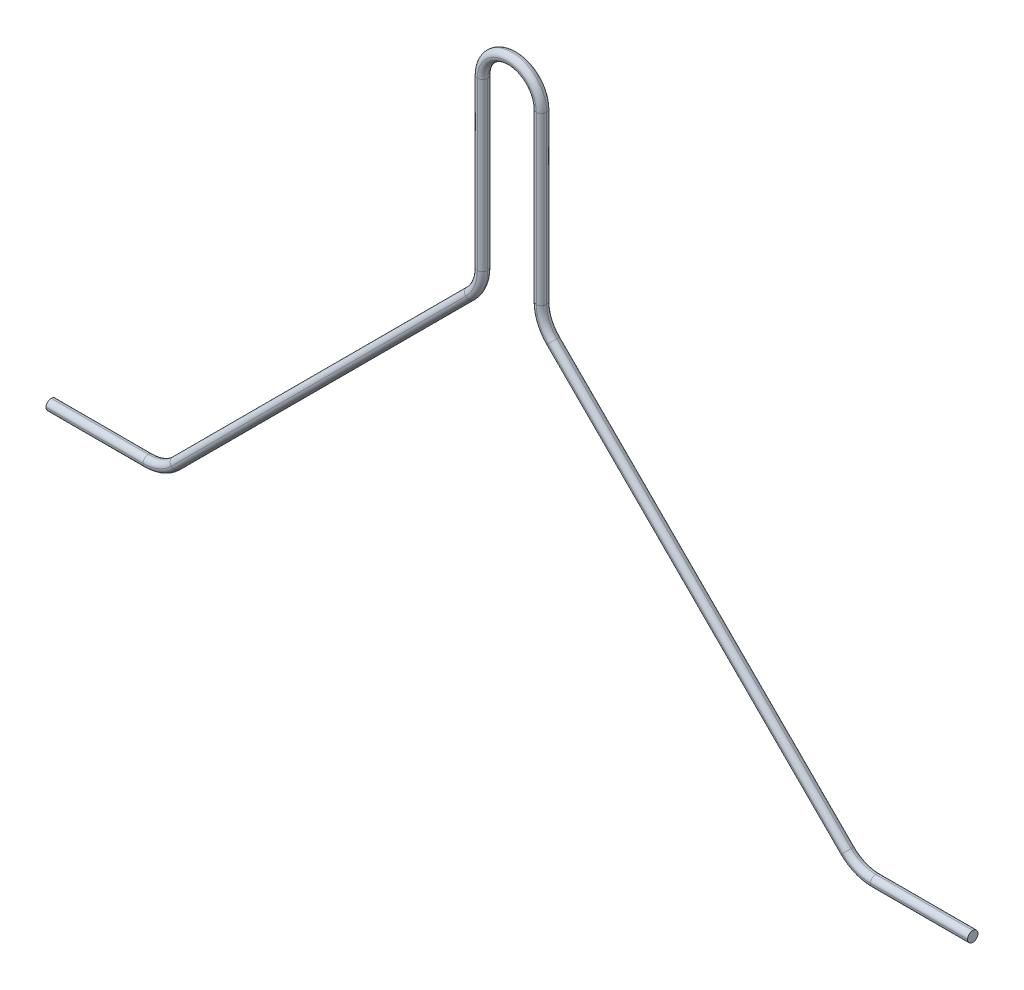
ISO-10303-21;
HEADER;
FILE_DESCRIPTION(('STEP AP214'),'2;1');
FILE_NAME('part.step','',(''),(''),'','','');
FILE_SCHEMA(('AUTOMOTIVE_DESIGN { 1 0 10303 214 1 1 1 1 }'));
ENDSEC;
DATA;
#1=APPLICATION_CONTEXT('core data for automotive mechanical design processes');
#2=APPLICATION_PROTOCOL_DEFINITION('international standard','automotive_design',2000,#1);
#3=PRODUCT_CONTEXT('',#1,'mechanical');
#4=PRODUCT('Part','Part','',(#3));
#5=PRODUCT_RELATED_PRODUCT_CATEGORY('part','',(#4));
#6=PRODUCT_DEFINITION_FORMATION('','',#4);
#7=PRODUCT_DEFINITION_CONTEXT('part definition',#1,'design');
#8=PRODUCT_DEFINITION('design','',#6,#7);
#9=PRODUCT_DEFINITION_SHAPE('','',#8);
#10=(LENGTH_UNIT() NAMED_UNIT(*) SI_UNIT(.MILLI.,.METRE.));
#11=(NAMED_UNIT(*) PLANE_ANGLE_UNIT() SI_UNIT($,.RADIAN.));
#12=(NAMED_UNIT(*) SI_UNIT($,.STERADIAN.) SOLID_ANGLE_UNIT());
#13=UNCERTAINTY_MEASURE_WITH_UNIT(LENGTH_MEASURE(1.E-05),#10,'distance_accuracy_value','');
#14=(GEOMETRIC_REPRESENTATION_CONTEXT(3) GLOBAL_UNCERTAINTY_ASSIGNED_CONTEXT((#13)) GLOBAL_UNIT_ASSIGNED_CONTEXT((#10,
#11,#12)) REPRESENTATION_CONTEXT('',''));
#15=CARTESIAN_POINT('',(0.,0.,0.));
#16=DIRECTION('',(0.,0.,1.));
#17=DIRECTION('',(1.,0.,0.));
#18=AXIS2_PLACEMENT_3D('',#15,#16,#17);
#19=CARTESIAN_POINT('',(-66.4264068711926,-71.4264068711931,1.5));
#20=DIRECTION('',(1.,0.,0.));
#21=DIRECTION('',(0.,0.,-1.));
#22=AXIS2_PLACEMENT_3D('',#19,#20,#21);
#23=PLANE('',#22);
#24=CARTESIAN_POINT('',(-66.4264068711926,-72.1764068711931,0.75));
#25=DIRECTION('',(1.,0.,0.));
#26=DIRECTION('',(0.,0.,-1.));
#27=AXIS2_PLACEMENT_3D('',#24,#25,#26);
#28=CIRCLE('',#27,0.75);
#29=CARTESIAN_POINT('',(-66.4264068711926,-71.4264068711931,0.75));
#30=VERTEX_POINT('',#29);
#31=CARTESIAN_POINT('',(-66.4264068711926,-72.1764068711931,0.));
#32=VERTEX_POINT('',#31);
#33=EDGE_CURVE('E43',#30,#32,#28,.F.);
#34=ORIENTED_EDGE('',*,*,#33,.T.);
#35=CARTESIAN_POINT('',(-66.4264068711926,-72.1764068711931,0.75));
#36=DIRECTION('',(1.,0.,0.));
#37=DIRECTION('',(0.,0.,-1.));
#38=AXIS2_PLACEMENT_3D('',#35,#36,#37);
#39=CIRCLE('',#38,0.75);
#40=CARTESIAN_POINT('',(-66.4264068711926,-72.9264068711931,0.75));
#41=VERTEX_POINT('',#40);
#42=EDGE_CURVE('E11',#32,#41,#39,.F.);
#43=ORIENTED_EDGE('',*,*,#42,.T.);
#44=CARTESIAN_POINT('',(-66.4264068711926,-72.1764068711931,0.75));
#45=DIRECTION('',(1.,0.,0.));
#46=DIRECTION('',(0.,0.,-1.));
#47=AXIS2_PLACEMENT_3D('',#44,#45,#46);
#48=CIRCLE('',#47,0.75);
#49=CARTESIAN_POINT('',(-66.4264068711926,-72.1764068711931,1.5));
#50=VERTEX_POINT('',#49);
#51=EDGE_CURVE('E218',#41,#50,#48,.F.);
#52=ORIENTED_EDGE('',*,*,#51,.T.);
#53=CARTESIAN_POINT('',(-66.4264068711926,-72.1764068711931,0.75));
#54=DIRECTION('',(1.,0.,0.));
#55=DIRECTION('',(0.,0.,-1.));
#56=AXIS2_PLACEMENT_3D('',#53,#54,#55);
#57=CIRCLE('',#56,0.75);
#58=EDGE_CURVE('E52',#50,#30,#57,.F.);
#59=ORIENTED_EDGE('',*,*,#58,.T.);
#60=EDGE_LOOP('',(#34,#43,#52,#59));
#61=FACE_BOUND('',#60,.T.);
#62=ADVANCED_FACE('F33',(#61),#23,.F.);
#63=CARTESIAN_POINT('',(66.4264068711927,-71.4264068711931,1.5));
#64=DIRECTION('',(-1.,0.,0.));
#65=DIRECTION('',(0.,0.,1.));
#66=AXIS2_PLACEMENT_3D('',#63,#64,#65);
#67=PLANE('',#66);
#68=CARTESIAN_POINT('',(66.4264068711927,-72.1764068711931,0.75));
#69=DIRECTION('',(-1.,0.,0.));
#70=DIRECTION('',(0.,0.,1.));
#71=AXIS2_PLACEMENT_3D('',#68,#69,#70);
#72=CIRCLE('',#71,0.75);
#73=CARTESIAN_POINT('',(66.4264068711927,-72.1764068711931,1.5));
#74=VERTEX_POINT('',#73);
#75=CARTESIAN_POINT('',(66.4264068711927,-72.9264068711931,0.75));
#76=VERTEX_POINT('',#75);
#77=EDGE_CURVE('E235',#74,#76,#72,.F.);
#78=ORIENTED_EDGE('',*,*,#77,.T.);
#79=CARTESIAN_POINT('',(66.4264068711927,-72.1764068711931,0.75));
#80=DIRECTION('',(-1.,0.,0.));
#81=DIRECTION('',(0.,0.,1.));
#82=AXIS2_PLACEMENT_3D('',#79,#80,#81);
#83=CIRCLE('',#82,0.75);
#84=CARTESIAN_POINT('',(66.4264068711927,-72.1764068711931,0.));
#85=VERTEX_POINT('',#84);
#86=EDGE_CURVE('E244',#76,#85,#83,.F.);
#87=ORIENTED_EDGE('',*,*,#86,.T.);
#88=CARTESIAN_POINT('',(66.4264068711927,-72.1764068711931,0.75));
#89=DIRECTION('',(-1.,0.,0.));
#90=DIRECTION('',(0.,0.,1.));
#91=AXIS2_PLACEMENT_3D('',#88,#89,#90);
#92=CIRCLE('',#91,0.75);
#93=CARTESIAN_POINT('',(66.4264068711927,-71.4264068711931,0.75));
#94=VERTEX_POINT('',#93);
#95=EDGE_CURVE('E240',#85,#94,#92,.F.);
#96=ORIENTED_EDGE('',*,*,#95,.T.);
#97=CARTESIAN_POINT('',(66.4264068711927,-72.1764068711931,0.75));
#98=DIRECTION('',(-1.,0.,0.));
#99=DIRECTION('',(0.,0.,1.));
#100=AXIS2_PLACEMENT_3D('',#97,#98,#99);
#101=CIRCLE('',#100,0.75);
#102=EDGE_CURVE('E234',#94,#74,#101,.F.);
#103=ORIENTED_EDGE('',*,*,#102,.T.);
#104=EDGE_LOOP('',(#78,#87,#96,#103));
#105=FACE_BOUND('',#104,.T.);
#106=ADVANCED_FACE('F587',(#105),#67,.F.);
#107=CARTESIAN_POINT('',(0.,-72.1764068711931,0.75));
#108=DIRECTION('',(-1.,0.,0.));
#109=DIRECTION('',(0.,-1.,0.));
#110=AXIS2_PLACEMENT_3D('',#107,#108,#109);
#111=CYLINDRICAL_SURFACE('',#110,0.75);
#112=DIRECTION('',(-1.,0.,0.));
#113=VECTOR('',#112,1.);
#114=CARTESIAN_POINT('',(-66.4264068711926,-71.4264068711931,0.75));
#115=LINE('',#114,#113);
#116=CARTESIAN_POINT('',(-52.4264068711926,-71.4264068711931,0.75));
#117=VERTEX_POINT('',#116);
#118=EDGE_CURVE('E37',#30,#117,#115,.F.);
#119=ORIENTED_EDGE('',*,*,#118,.F.);
#120=ORIENTED_EDGE('',*,*,#58,.F.);
#121=DIRECTION('',(-1.,0.,0.));
#122=VECTOR('',#121,1.);
#123=CARTESIAN_POINT('',(0.,-72.1764068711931,1.5));
#124=LINE('',#123,#122);
#125=CARTESIAN_POINT('',(-52.4264068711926,-72.1764068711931,1.5));
#126=VERTEX_POINT('',#125);
#127=EDGE_CURVE('E176',#126,#50,#124,.T.);
#128=ORIENTED_EDGE('',*,*,#127,.F.);
#129=CARTESIAN_POINT('',(-52.4264068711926,-72.1764068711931,0.75));
#130=DIRECTION('',(1.,0.,0.));
#131=DIRECTION('',(0.,0.,-1.));
#132=AXIS2_PLACEMENT_3D('',#129,#130,#131);
#133=CIRCLE('',#132,0.75);
#134=EDGE_CURVE('E233',#117,#126,#133,.T.);
#135=ORIENTED_EDGE('',*,*,#134,.F.);
#136=EDGE_LOOP('',(#119,#120,#128,#135));
#137=FACE_BOUND('',#136,.T.);
#138=ADVANCED_FACE('F35',(#137),#111,.T.);
#139=CARTESIAN_POINT('',(-66.4264068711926,-72.1764068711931,0.75));
#140=DIRECTION('',(1.,0.,0.));
#141=DIRECTION('',(0.,1.,0.));
#142=AXIS2_PLACEMENT_3D('',#139,#140,#141);
#143=CYLINDRICAL_SURFACE('',#142,0.75);
#144=ORIENTED_EDGE('',*,*,#33,.F.);
#145=ORIENTED_EDGE('',*,*,#118,.T.);
#146=CARTESIAN_POINT('',(-52.4264068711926,-72.1764068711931,0.75));
#147=DIRECTION('',(1.,0.,0.));
#148=DIRECTION('',(0.,0.,-1.));
#149=AXIS2_PLACEMENT_3D('',#146,#147,#148);
#150=CIRCLE('',#149,0.75);
#151=CARTESIAN_POINT('',(-52.4264068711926,-72.1764068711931,0.));
#152=VERTEX_POINT('',#151);
#153=EDGE_CURVE('E225',#152,#117,#150,.T.);
#154=ORIENTED_EDGE('',*,*,#153,.F.);
#155=DIRECTION('',(-1.,0.,0.));
#156=VECTOR('',#155,1.);
#157=CARTESIAN_POINT('',(-52.4264068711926,-72.1764068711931,0.));
#158=LINE('',#157,#156);
#159=EDGE_CURVE('E215',#32,#152,#158,.F.);
#160=ORIENTED_EDGE('',*,*,#159,.F.);
#161=EDGE_LOOP('',(#144,#145,#154,#160));
#162=FACE_BOUND('',#161,.T.);
#163=ADVANCED_FACE('F223',(#162),#143,.T.);
#164=CARTESIAN_POINT('',(0.,-72.1764068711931,0.75));
#165=DIRECTION('',(1.,0.,0.));
#166=DIRECTION('',(0.,0.,-1.));
#167=AXIS2_PLACEMENT_3D('',#164,#165,#166);
#168=CYLINDRICAL_SURFACE('',#167,0.75);
#169=ORIENTED_EDGE('',*,*,#127,.T.);
#170=ORIENTED_EDGE('',*,*,#51,.F.);
#171=DIRECTION('',(1.,0.,0.));
#172=VECTOR('',#171,1.);
#173=CARTESIAN_POINT('',(-66.4264068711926,-72.9264068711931,0.75));
#174=LINE('',#173,#172);
#175=CARTESIAN_POINT('',(-52.4264068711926,-72.9264068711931,0.75));
#176=VERTEX_POINT('',#175);
#177=EDGE_CURVE('E205',#176,#41,#174,.F.);
#178=ORIENTED_EDGE('',*,*,#177,.F.);
#179=CARTESIAN_POINT('',(-52.4264068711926,-72.1764068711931,0.75));
#180=DIRECTION('',(1.,0.,0.));
#181=DIRECTION('',(0.,0.,-1.));
#182=AXIS2_PLACEMENT_3D('',#179,#180,#181);
#183=CIRCLE('',#182,0.75);
#184=EDGE_CURVE('E216',#126,#176,#183,.T.);
#185=ORIENTED_EDGE('',*,*,#184,.F.);
#186=EDGE_LOOP('',(#169,#170,#178,#185));
#187=FACE_BOUND('',#186,.T.);
#188=ADVANCED_FACE('F219',(#187),#168,.T.);
#189=CARTESIAN_POINT('',(-52.4264068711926,-66.4264068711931,0.75));
#190=DIRECTION('',(0.,0.,-1.));
#191=DIRECTION('',(-1.,0.,0.));
#192=AXIS2_PLACEMENT_3D('',#189,#190,#191);
#193=TOROIDAL_SURFACE('',#192,5.74999999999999,0.75);
#194=CARTESIAN_POINT('',(-52.4264068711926,-66.4264068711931,0.75));
#195=DIRECTION('',(0.,0.,-1.));
#196=DIRECTION('',(-1.,0.,0.));
#197=AXIS2_PLACEMENT_3D('',#194,#195,#196);
#198=CIRCLE('',#197,4.99999999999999);
#199=CARTESIAN_POINT('',(-48.8908729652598,-69.9619407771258,0.75));
#200=VERTEX_POINT('',#199);
#201=EDGE_CURVE('E228',#117,#200,#198,.F.);
#202=ORIENTED_EDGE('',*,*,#201,.F.);
#203=ORIENTED_EDGE('',*,*,#134,.T.);
#204=CARTESIAN_POINT('',(-52.4264068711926,-66.4264068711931,1.5));
#205=DIRECTION('',(0.,0.,-1.));
#206=DIRECTION('',(-1.,0.,0.));
#207=AXIS2_PLACEMENT_3D('',#204,#205,#206);
#208=CIRCLE('',#207,5.74999999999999);
#209=CARTESIAN_POINT('',(-48.3605428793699,-70.4922708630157,1.5));
#210=VERTEX_POINT('',#209);
#211=EDGE_CURVE('E459',#210,#126,#208,.T.);
#212=ORIENTED_EDGE('',*,*,#211,.F.);
#213=CARTESIAN_POINT('',(-48.3605428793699,-70.4922708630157,0.75));
#214=DIRECTION('',(0.707106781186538,0.707106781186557,0.));
#215=DIRECTION('',(-0.707106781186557,0.707106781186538,0.));
#216=AXIS2_PLACEMENT_3D('',#213,#214,#215);
#217=CIRCLE('',#216,0.75);
#218=EDGE_CURVE('E456',#200,#210,#217,.T.);
#219=ORIENTED_EDGE('',*,*,#218,.F.);
#220=EDGE_LOOP('',(#202,#203,#212,#219));
#221=FACE_BOUND('',#220,.T.);
#222=ADVANCED_FACE('F467',(#221),#193,.T.);
#223=CARTESIAN_POINT('',(-52.4264068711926,-66.4264068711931,0.75));
#224=DIRECTION('',(0.,0.,-1.));
#225=DIRECTION('',(-1.,0.,0.));
#226=AXIS2_PLACEMENT_3D('',#223,#224,#225);
#227=TOROIDAL_SURFACE('',#226,5.74999999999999,0.75);
#228=ORIENTED_EDGE('',*,*,#153,.T.);
#229=ORIENTED_EDGE('',*,*,#201,.T.);
#230=CARTESIAN_POINT('',(-48.3605428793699,-70.4922708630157,0.75));
#231=DIRECTION('',(0.707106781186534,0.707106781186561,0.));
#232=DIRECTION('',(-0.707106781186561,0.707106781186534,0.));
#233=AXIS2_PLACEMENT_3D('',#230,#231,#232);
#234=CIRCLE('',#233,0.75);
#235=CARTESIAN_POINT('',(-48.3605428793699,-70.4922708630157,0.));
#236=VERTEX_POINT('',#235);
#237=EDGE_CURVE('E451',#236,#200,#234,.T.);
#238=ORIENTED_EDGE('',*,*,#237,.F.);
#239=CARTESIAN_POINT('',(-52.4264068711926,-66.4264068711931,0.));
#240=DIRECTION('',(0.,0.,-1.));
#241=DIRECTION('',(-1.,0.,0.));
#242=AXIS2_PLACEMENT_3D('',#239,#240,#241);
#243=CIRCLE('',#242,5.74999999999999);
#244=EDGE_CURVE('E448',#152,#236,#243,.F.);
#245=ORIENTED_EDGE('',*,*,#244,.F.);
#246=EDGE_LOOP('',(#228,#229,#238,#245));
#247=FACE_BOUND('',#246,.T.);
#248=ADVANCED_FACE('F477',(#247),#227,.T.);
#249=CARTESIAN_POINT('',(-66.4264068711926,-72.1764068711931,0.75));
#250=DIRECTION('',(-1.,0.,0.));
#251=DIRECTION('',(0.,0.,1.));
#252=AXIS2_PLACEMENT_3D('',#249,#250,#251);
#253=CYLINDRICAL_SURFACE('',#252,0.75);
#254=ORIENTED_EDGE('',*,*,#42,.F.);
#255=ORIENTED_EDGE('',*,*,#159,.T.);
#256=CARTESIAN_POINT('',(-52.4264068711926,-72.1764068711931,0.75));
#257=DIRECTION('',(1.,0.,0.));
#258=DIRECTION('',(0.,0.,-1.));
#259=AXIS2_PLACEMENT_3D('',#256,#257,#258);
#260=CIRCLE('',#259,0.75);
#261=EDGE_CURVE('E210',#176,#152,#260,.T.);
#262=ORIENTED_EDGE('',*,*,#261,.F.);
#263=ORIENTED_EDGE('',*,*,#177,.T.);
#264=EDGE_LOOP('',(#254,#255,#262,#263));
#265=FACE_BOUND('',#264,.T.);
#266=ADVANCED_FACE('F207',(#265),#253,.T.);
#267=CARTESIAN_POINT('',(-52.4264068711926,-66.4264068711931,0.75));
#268=DIRECTION('',(0.,0.,-1.));
#269=DIRECTION('',(-1.,0.,0.));
#270=AXIS2_PLACEMENT_3D('',#267,#268,#269);
#271=TOROIDAL_SURFACE('',#270,5.74999999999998,0.75);
#272=ORIENTED_EDGE('',*,*,#211,.T.);
#273=ORIENTED_EDGE('',*,*,#184,.T.);
#274=CARTESIAN_POINT('',(-52.4264068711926,-66.4264068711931,0.75));
#275=DIRECTION('',(0.,0.,-1.));
#276=DIRECTION('',(-1.,0.,0.));
#277=AXIS2_PLACEMENT_3D('',#274,#275,#276);
#278=CIRCLE('',#277,6.49999999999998);
#279=CARTESIAN_POINT('',(-47.83021279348,-71.0226009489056,0.75));
#280=VERTEX_POINT('',#279);
#281=EDGE_CURVE('E445',#280,#176,#278,.T.);
#282=ORIENTED_EDGE('',*,*,#281,.F.);
#283=CARTESIAN_POINT('',(-48.3605428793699,-70.4922708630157,0.75));
#284=DIRECTION('',(0.707106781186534,0.707106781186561,0.));
#285=DIRECTION('',(-0.707106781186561,0.707106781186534,0.));
#286=AXIS2_PLACEMENT_3D('',#283,#284,#285);
#287=CIRCLE('',#286,0.75);
#288=EDGE_CURVE('E442',#210,#280,#287,.T.);
#289=ORIENTED_EDGE('',*,*,#288,.F.);
#290=EDGE_LOOP('',(#272,#273,#282,#289));
#291=FACE_BOUND('',#290,.T.);
#292=ADVANCED_FACE('F462',(#291),#271,.T.);
#293=CARTESIAN_POINT('',(11.0658639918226,-11.0658639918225,0.75));
#294=DIRECTION('',(-0.707106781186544,-0.707106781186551,0.));
#295=DIRECTION('',(0.707106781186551,-0.707106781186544,0.));
#296=AXIS2_PLACEMENT_3D('',#293,#294,#295);
#297=CYLINDRICAL_SURFACE('',#296,0.75);
#298=DIRECTION('',(-0.707106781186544,-0.707106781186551,0.));
#299=VECTOR('',#298,1.);
#300=CARTESIAN_POINT('',(-6.46446609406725,-27.5355339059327,0.75));
#301=LINE('',#300,#299);
#302=CARTESIAN_POINT('',(-6.46446609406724,-27.5355339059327,0.75));
#303=VERTEX_POINT('',#302);
#304=EDGE_CURVE('E454',#200,#303,#301,.F.);
#305=ORIENTED_EDGE('',*,*,#304,.F.);
#306=ORIENTED_EDGE('',*,*,#218,.T.);
#307=DIRECTION('',(-0.707106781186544,-0.707106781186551,0.));
#308=VECTOR('',#307,1.);
#309=CARTESIAN_POINT('',(11.0658639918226,-11.0658639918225,1.5));
#310=LINE('',#309,#308);
#311=CARTESIAN_POINT('',(-5.93413600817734,-28.0658639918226,1.5));
#312=VERTEX_POINT('',#311);
#313=EDGE_CURVE('E439',#312,#210,#310,.T.);
#314=ORIENTED_EDGE('',*,*,#313,.F.);
#315=CARTESIAN_POINT('',(-5.93413600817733,-28.0658639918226,0.75));
#316=DIRECTION('',(0.707106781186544,0.707106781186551,0.));
#317=DIRECTION('',(-0.707106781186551,0.707106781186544,0.));
#318=AXIS2_PLACEMENT_3D('',#315,#316,#317);
#319=CIRCLE('',#318,0.75);
#320=EDGE_CURVE('E436',#303,#312,#319,.T.);
#321=ORIENTED_EDGE('',*,*,#320,.F.);
#322=EDGE_LOOP('',(#305,#306,#314,#321));
#323=FACE_BOUND('',#322,.T.);
#324=ADVANCED_FACE('F470',(#323),#297,.T.);
#325=CARTESIAN_POINT('',(-5.93413600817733,-28.0658639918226,0.75));
#326=DIRECTION('',(0.707106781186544,0.707106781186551,0.));
#327=DIRECTION('',(-0.707106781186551,0.707106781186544,0.));
#328=AXIS2_PLACEMENT_3D('',#325,#326,#327);
#329=CYLINDRICAL_SURFACE('',#328,0.75);
#330=ORIENTED_EDGE('',*,*,#237,.T.);
#331=ORIENTED_EDGE('',*,*,#304,.T.);
#332=CARTESIAN_POINT('',(-5.93413600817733,-28.0658639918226,0.75));
#333=DIRECTION('',(0.707106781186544,0.707106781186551,0.));
#334=DIRECTION('',(-0.707106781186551,0.707106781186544,0.));
#335=AXIS2_PLACEMENT_3D('',#332,#333,#334);
#336=CIRCLE('',#335,0.75);
#337=CARTESIAN_POINT('',(-5.93413600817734,-28.0658639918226,0.));
#338=VERTEX_POINT('',#337);
#339=EDGE_CURVE('E431',#338,#303,#336,.T.);
#340=ORIENTED_EDGE('',*,*,#339,.F.);
#341=DIRECTION('',(-0.707106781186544,-0.707106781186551,0.));
#342=VECTOR('',#341,1.);
#343=CARTESIAN_POINT('',(-5.93413600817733,-28.0658639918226,0.));
#344=LINE('',#343,#342);
#345=EDGE_CURVE('E428',#236,#338,#344,.F.);
#346=ORIENTED_EDGE('',*,*,#345,.F.);
#347=EDGE_LOOP('',(#330,#331,#340,#346));
#348=FACE_BOUND('',#347,.T.);
#349=ADVANCED_FACE('F475',(#348),#329,.T.);
#350=CARTESIAN_POINT('',(-52.4264068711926,-66.4264068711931,0.75));
#351=DIRECTION('',(0.,0.,-1.));
#352=DIRECTION('',(-1.,0.,0.));
#353=AXIS2_PLACEMENT_3D('',#350,#351,#352);
#354=TOROIDAL_SURFACE('',#353,5.74999999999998,0.75);
#355=ORIENTED_EDGE('',*,*,#261,.T.);
#356=ORIENTED_EDGE('',*,*,#244,.T.);
#357=CARTESIAN_POINT('',(-48.3605428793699,-70.4922708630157,0.75));
#358=DIRECTION('',(0.707106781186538,0.707106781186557,0.));
#359=DIRECTION('',(-0.707106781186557,0.707106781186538,0.));
#360=AXIS2_PLACEMENT_3D('',#357,#358,#359);
#361=CIRCLE('',#360,0.75);
#362=EDGE_CURVE('E425',#280,#236,#361,.T.);
#363=ORIENTED_EDGE('',*,*,#362,.F.);
#364=ORIENTED_EDGE('',*,*,#281,.T.);
#365=EDGE_LOOP('',(#355,#356,#363,#364));
#366=FACE_BOUND('',#365,.T.);
#367=ADVANCED_FACE('F480',(#366),#354,.T.);
#368=CARTESIAN_POINT('',(11.0658639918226,-11.0658639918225,0.75));
#369=DIRECTION('',(0.707106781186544,0.707106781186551,0.));
#370=DIRECTION('',(-0.707106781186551,0.707106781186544,0.));
#371=AXIS2_PLACEMENT_3D('',#368,#369,#370);
#372=CYLINDRICAL_SURFACE('',#371,0.75);
#373=ORIENTED_EDGE('',*,*,#313,.T.);
#374=ORIENTED_EDGE('',*,*,#288,.T.);
#375=DIRECTION('',(0.707106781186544,0.707106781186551,0.));
#376=VECTOR('',#375,1.);
#377=CARTESIAN_POINT('',(-5.40380592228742,-28.5961940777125,0.75));
#378=LINE('',#377,#376);
#379=CARTESIAN_POINT('',(-5.40380592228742,-28.5961940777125,0.75));
#380=VERTEX_POINT('',#379);
#381=EDGE_CURVE('E422',#380,#280,#378,.F.);
#382=ORIENTED_EDGE('',*,*,#381,.F.);
#383=CARTESIAN_POINT('',(-5.93413600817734,-28.0658639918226,0.75));
#384=DIRECTION('',(0.707106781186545,0.70710678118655,0.));
#385=DIRECTION('',(-0.70710678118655,0.707106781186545,0.));
#386=AXIS2_PLACEMENT_3D('',#383,#384,#385);
#387=CIRCLE('',#386,0.75);
#388=EDGE_CURVE('E419',#312,#380,#387,.T.);
#389=ORIENTED_EDGE('',*,*,#388,.F.);
#390=EDGE_LOOP('',(#373,#374,#382,#389));
#391=FACE_BOUND('',#390,.T.);
#392=ADVANCED_FACE('F486',(#391),#372,.T.);
#393=CARTESIAN_POINT('',(-9.99999999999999,-24.,0.75));
#394=DIRECTION('',(0.,0.,-1.));
#395=DIRECTION('',(-1.,0.,0.));
#396=AXIS2_PLACEMENT_3D('',#393,#394,#395);
#397=TOROIDAL_SURFACE('',#396,5.74999999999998,0.75);
#398=CARTESIAN_POINT('',(-9.99999999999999,-24.,0.75));
#399=DIRECTION('',(0.,0.,-1.));
#400=DIRECTION('',(-1.,0.,0.));
#401=AXIS2_PLACEMENT_3D('',#398,#399,#400);
#402=CIRCLE('',#401,4.99999999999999);
#403=CARTESIAN_POINT('',(-5.00000000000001,-24.,0.75));
#404=VERTEX_POINT('',#403);
#405=EDGE_CURVE('E434',#303,#404,#402,.F.);
#406=ORIENTED_EDGE('',*,*,#405,.F.);
#407=ORIENTED_EDGE('',*,*,#320,.T.);
#408=CARTESIAN_POINT('',(-9.99999999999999,-24.,1.5));
#409=DIRECTION('',(0.,0.,-1.));
#410=DIRECTION('',(-1.,0.,0.));
#411=AXIS2_PLACEMENT_3D('',#408,#409,#410);
#412=CIRCLE('',#411,5.74999999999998);
#413=CARTESIAN_POINT('',(-4.25000000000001,-24.,1.5));
#414=VERTEX_POINT('',#413);
#415=EDGE_CURVE('E416',#414,#312,#412,.T.);
#416=ORIENTED_EDGE('',*,*,#415,.F.);
#417=CARTESIAN_POINT('',(-4.25000000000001,-24.,0.75));
#418=DIRECTION('',(0.,1.,0.));
#419=DIRECTION('',(0.,0.,1.));
#420=AXIS2_PLACEMENT_3D('',#417,#418,#419);
#421=CIRCLE('',#420,0.75);
#422=EDGE_CURVE('E413',#404,#414,#421,.T.);
#423=ORIENTED_EDGE('',*,*,#422,.F.);
#424=EDGE_LOOP('',(#406,#407,#416,#423));
#425=FACE_BOUND('',#424,.T.);
#426=ADVANCED_FACE('F492',(#425),#397,.T.);
#427=CARTESIAN_POINT('',(-9.99999999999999,-24.,0.75));
#428=DIRECTION('',(0.,0.,-1.));
#429=DIRECTION('',(-1.,0.,0.));
#430=AXIS2_PLACEMENT_3D('',#427,#428,#429);
#431=TOROIDAL_SURFACE('',#430,5.74999999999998,0.75);
#432=ORIENTED_EDGE('',*,*,#339,.T.);
#433=ORIENTED_EDGE('',*,*,#405,.T.);
#434=CARTESIAN_POINT('',(-4.25000000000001,-24.,0.75));
#435=DIRECTION('',(0.,1.,0.));
#436=DIRECTION('',(0.,0.,1.));
#437=AXIS2_PLACEMENT_3D('',#434,#435,#436);
#438=CIRCLE('',#437,0.75);
#439=CARTESIAN_POINT('',(-4.25000000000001,-24.,0.));
#440=VERTEX_POINT('',#439);
#441=EDGE_CURVE('E408',#440,#404,#438,.T.);
#442=ORIENTED_EDGE('',*,*,#441,.F.);
#443=CARTESIAN_POINT('',(-9.99999999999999,-24.,0.));
#444=DIRECTION('',(0.,0.,-1.));
#445=DIRECTION('',(-1.,0.,0.));
#446=AXIS2_PLACEMENT_3D('',#443,#444,#445);
#447=CIRCLE('',#446,5.74999999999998);
#448=EDGE_CURVE('E405',#338,#440,#447,.F.);
#449=ORIENTED_EDGE('',*,*,#448,.F.);
#450=EDGE_LOOP('',(#432,#433,#442,#449));
#451=FACE_BOUND('',#450,.T.);
#452=ADVANCED_FACE('F503',(#451),#431,.T.);
#453=CARTESIAN_POINT('',(-5.93413600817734,-28.0658639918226,0.75));
#454=DIRECTION('',(-0.707106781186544,-0.707106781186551,0.));
#455=DIRECTION('',(0.707106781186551,-0.707106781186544,0.));
#456=AXIS2_PLACEMENT_3D('',#453,#454,#455);
#457=CYLINDRICAL_SURFACE('',#456,0.75);
#458=ORIENTED_EDGE('',*,*,#362,.T.);
#459=ORIENTED_EDGE('',*,*,#345,.T.);
#460=CARTESIAN_POINT('',(-5.93413600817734,-28.0658639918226,0.75));
#461=DIRECTION('',(0.707106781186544,0.707106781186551,0.));
#462=DIRECTION('',(-0.707106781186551,0.707106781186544,0.));
#463=AXIS2_PLACEMENT_3D('',#460,#461,#462);
#464=CIRCLE('',#463,0.75);
#465=EDGE_CURVE('E402',#380,#338,#464,.T.);
#466=ORIENTED_EDGE('',*,*,#465,.F.);
#467=ORIENTED_EDGE('',*,*,#381,.T.);
#468=EDGE_LOOP('',(#458,#459,#466,#467));
#469=FACE_BOUND('',#468,.T.);
#470=ADVANCED_FACE('F483',(#469),#457,.T.);
#471=CARTESIAN_POINT('',(-9.99999999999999,-24.,0.75));
#472=DIRECTION('',(0.,0.,-1.));
#473=DIRECTION('',(-1.,0.,0.));
#474=AXIS2_PLACEMENT_3D('',#471,#472,#473);
#475=TOROIDAL_SURFACE('',#474,5.74999999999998,0.75);
#476=ORIENTED_EDGE('',*,*,#415,.T.);
#477=ORIENTED_EDGE('',*,*,#388,.T.);
#478=CARTESIAN_POINT('',(-9.99999999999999,-24.,0.75));
#479=DIRECTION('',(0.,0.,-1.));
#480=DIRECTION('',(-1.,0.,0.));
#481=AXIS2_PLACEMENT_3D('',#478,#479,#480);
#482=CIRCLE('',#481,6.49999999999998);
#483=CARTESIAN_POINT('',(-3.50000000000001,-24.,0.75));
#484=VERTEX_POINT('',#483);
#485=EDGE_CURVE('E399',#484,#380,#482,.T.);
#486=ORIENTED_EDGE('',*,*,#485,.F.);
#487=CARTESIAN_POINT('',(-4.25000000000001,-24.,0.75));
#488=DIRECTION('',(0.,1.,0.));
#489=DIRECTION('',(0.,0.,1.));
#490=AXIS2_PLACEMENT_3D('',#487,#488,#489);
#491=CIRCLE('',#490,0.75);
#492=EDGE_CURVE('E396',#414,#484,#491,.T.);
#493=ORIENTED_EDGE('',*,*,#492,.F.);
#494=EDGE_LOOP('',(#476,#477,#486,#493));
#495=FACE_BOUND('',#494,.T.);
#496=ADVANCED_FACE('F488',(#495),#475,.T.);
#497=CARTESIAN_POINT('',(-4.25,0.,0.75));
#498=DIRECTION('',(0.,-1.,0.));
#499=DIRECTION('',(1.,0.,0.));
#500=AXIS2_PLACEMENT_3D('',#497,#498,#499);
#501=CYLINDRICAL_SURFACE('',#500,0.75);
#502=DIRECTION('',(0.,-1.,0.));
#503=VECTOR('',#502,1.);
#504=CARTESIAN_POINT('',(-5.,0.,0.75));
#505=LINE('',#504,#503);
#506=CARTESIAN_POINT('',(-5.,0.,0.75));
#507=VERTEX_POINT('',#506);
#508=EDGE_CURVE('E411',#404,#507,#505,.F.);
#509=ORIENTED_EDGE('',*,*,#508,.F.);
#510=ORIENTED_EDGE('',*,*,#422,.T.);
#511=DIRECTION('',(0.,-1.,0.));
#512=VECTOR('',#511,1.);
#513=CARTESIAN_POINT('',(-4.25,0.,1.5));
#514=LINE('',#513,#512);
#515=CARTESIAN_POINT('',(-4.25,0.,1.5));
#516=VERTEX_POINT('',#515);
#517=EDGE_CURVE('E393',#516,#414,#514,.T.);
#518=ORIENTED_EDGE('',*,*,#517,.F.);
#519=CARTESIAN_POINT('',(-4.25,0.,0.75));
#520=DIRECTION('',(0.,1.,0.));
#521=DIRECTION('',(-1.,0.,0.));
#522=AXIS2_PLACEMENT_3D('',#519,#520,#521);
#523=CIRCLE('',#522,0.75);
#524=EDGE_CURVE('E390',#507,#516,#523,.T.);
#525=ORIENTED_EDGE('',*,*,#524,.F.);
#526=EDGE_LOOP('',(#509,#510,#518,#525));
#527=FACE_BOUND('',#526,.T.);
#528=ADVANCED_FACE('F495',(#527),#501,.T.);
#529=CARTESIAN_POINT('',(-4.25,0.,0.75));
#530=DIRECTION('',(0.,1.,0.));
#531=DIRECTION('',(-1.,0.,0.));
#532=AXIS2_PLACEMENT_3D('',#529,#530,#531);
#533=CYLINDRICAL_SURFACE('',#532,0.75);
#534=ORIENTED_EDGE('',*,*,#441,.T.);
#535=ORIENTED_EDGE('',*,*,#508,.T.);
#536=CARTESIAN_POINT('',(-4.25,0.,0.75));
#537=DIRECTION('',(0.,1.,0.));
#538=DIRECTION('',(-1.,0.,0.));
#539=AXIS2_PLACEMENT_3D('',#536,#537,#538);
#540=CIRCLE('',#539,0.75);
#541=CARTESIAN_POINT('',(-4.25,0.,0.));
#542=VERTEX_POINT('',#541);
#543=EDGE_CURVE('E385',#542,#507,#540,.T.);
#544=ORIENTED_EDGE('',*,*,#543,.F.);
#545=DIRECTION('',(0.,-1.,0.));
#546=VECTOR('',#545,1.);
#547=CARTESIAN_POINT('',(-4.25,0.,0.));
#548=LINE('',#547,#546);
#549=EDGE_CURVE('E382',#440,#542,#548,.F.);
#550=ORIENTED_EDGE('',*,*,#549,.F.);
#551=EDGE_LOOP('',(#534,#535,#544,#550));
#552=FACE_BOUND('',#551,.T.);
#553=ADVANCED_FACE('F500',(#552),#533,.T.);
#554=CARTESIAN_POINT('',(-9.99999999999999,-24.,0.75));
#555=DIRECTION('',(0.,0.,-1.));
#556=DIRECTION('',(-1.,0.,0.));
#557=AXIS2_PLACEMENT_3D('',#554,#555,#556);
#558=TOROIDAL_SURFACE('',#557,5.74999999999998,0.75);
#559=ORIENTED_EDGE('',*,*,#465,.T.);
#560=ORIENTED_EDGE('',*,*,#448,.T.);
#561=CARTESIAN_POINT('',(-4.25000000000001,-24.,0.75));
#562=DIRECTION('',(0.,1.,0.));
#563=DIRECTION('',(0.,0.,1.));
#564=AXIS2_PLACEMENT_3D('',#561,#562,#563);
#565=CIRCLE('',#564,0.75);
#566=EDGE_CURVE('E379',#484,#440,#565,.T.);
#567=ORIENTED_EDGE('',*,*,#566,.F.);
#568=ORIENTED_EDGE('',*,*,#485,.T.);
#569=EDGE_LOOP('',(#559,#560,#567,#568));
#570=FACE_BOUND('',#569,.T.);
#571=ADVANCED_FACE('F506',(#570),#558,.T.);
#572=CARTESIAN_POINT('',(-4.25,0.,0.75));
#573=DIRECTION('',(0.,1.,0.));
#574=DIRECTION('',(-1.,0.,0.));
#575=AXIS2_PLACEMENT_3D('',#572,#573,#574);
#576=CYLINDRICAL_SURFACE('',#575,0.75);
#577=ORIENTED_EDGE('',*,*,#517,.T.);
#578=ORIENTED_EDGE('',*,*,#492,.T.);
#579=DIRECTION('',(0.,1.,0.));
#580=VECTOR('',#579,1.);
#581=CARTESIAN_POINT('',(-3.5,0.,0.75));
#582=LINE('',#581,#580);
#583=CARTESIAN_POINT('',(-3.5,0.,0.75));
#584=VERTEX_POINT('',#583);
#585=EDGE_CURVE('E376',#584,#484,#582,.F.);
#586=ORIENTED_EDGE('',*,*,#585,.F.);
#587=CARTESIAN_POINT('',(-4.25,0.,0.75));
#588=DIRECTION('',(0.,1.,0.));
#589=DIRECTION('',(-1.,0.,0.));
#590=AXIS2_PLACEMENT_3D('',#587,#588,#589);
#591=CIRCLE('',#590,0.75);
#592=EDGE_CURVE('E373',#516,#584,#591,.T.);
#593=ORIENTED_EDGE('',*,*,#592,.F.);
#594=EDGE_LOOP('',(#577,#578,#586,#593));
#595=FACE_BOUND('',#594,.T.);
#596=ADVANCED_FACE('F512',(#595),#576,.T.);
#597=CARTESIAN_POINT('',(0.,0.,0.75));
#598=DIRECTION('',(0.,0.,-1.));
#599=DIRECTION('',(-1.,0.,0.));
#600=AXIS2_PLACEMENT_3D('',#597,#598,#599);
#601=TOROIDAL_SURFACE('',#600,4.25,0.75);
#602=CARTESIAN_POINT('',(0.,0.,0.75));
#603=DIRECTION('',(0.,0.,-1.));
#604=DIRECTION('',(-1.,0.,0.));
#605=AXIS2_PLACEMENT_3D('',#602,#603,#604);
#606=CIRCLE('',#605,5.);
#607=CARTESIAN_POINT('',(5.,0.,0.75));
#608=VERTEX_POINT('',#607);
#609=EDGE_CURVE('E388',#507,#608,#606,.T.);
#610=ORIENTED_EDGE('',*,*,#609,.F.);
#611=ORIENTED_EDGE('',*,*,#524,.T.);
#612=CARTESIAN_POINT('',(0.,0.,1.5));
#613=DIRECTION('',(0.,0.,-1.));
#614=DIRECTION('',(-1.,0.,0.));
#615=AXIS2_PLACEMENT_3D('',#612,#613,#614);
#616=CIRCLE('',#615,4.25);
#617=CARTESIAN_POINT('',(4.25,0.,1.5));
#618=VERTEX_POINT('',#617);
#619=EDGE_CURVE('E370',#618,#516,#616,.F.);
#620=ORIENTED_EDGE('',*,*,#619,.F.);
#621=CARTESIAN_POINT('',(4.25,0.,0.75));
#622=DIRECTION('',(0.,-1.,0.));
#623=DIRECTION('',(0.,0.,-1.));
#624=AXIS2_PLACEMENT_3D('',#621,#622,#623);
#625=CIRCLE('',#624,0.75);
#626=EDGE_CURVE('E367',#608,#618,#625,.T.);
#627=ORIENTED_EDGE('',*,*,#626,.F.);
#628=EDGE_LOOP('',(#610,#611,#620,#627));
#629=FACE_BOUND('',#628,.T.);
#630=ADVANCED_FACE('F518',(#629),#601,.T.);
#631=CARTESIAN_POINT('',(0.,0.,0.75));
#632=DIRECTION('',(0.,0.,-1.));
#633=DIRECTION('',(-1.,0.,0.));
#634=AXIS2_PLACEMENT_3D('',#631,#632,#633);
#635=TOROIDAL_SURFACE('',#634,4.25,0.75);
#636=ORIENTED_EDGE('',*,*,#543,.T.);
#637=ORIENTED_EDGE('',*,*,#609,.T.);
#638=CARTESIAN_POINT('',(4.25,0.,0.75));
#639=DIRECTION('',(0.,-1.,0.));
#640=DIRECTION('',(1.,0.,0.));
#641=AXIS2_PLACEMENT_3D('',#638,#639,#640);
#642=CIRCLE('',#641,0.75);
#643=CARTESIAN_POINT('',(4.25,0.,0.));
#644=VERTEX_POINT('',#643);
#645=EDGE_CURVE('E362',#644,#608,#642,.T.);
#646=ORIENTED_EDGE('',*,*,#645,.F.);
#647=CARTESIAN_POINT('',(0.,0.,0.));
#648=DIRECTION('',(0.,0.,-1.));
#649=DIRECTION('',(-1.,0.,0.));
#650=AXIS2_PLACEMENT_3D('',#647,#648,#649);
#651=CIRCLE('',#650,4.25);
#652=EDGE_CURVE('E359',#542,#644,#651,.T.);
#653=ORIENTED_EDGE('',*,*,#652,.F.);
#654=EDGE_LOOP('',(#636,#637,#646,#653));
#655=FACE_BOUND('',#654,.T.);
#656=ADVANCED_FACE('F529',(#655),#635,.T.);
#657=CARTESIAN_POINT('',(-4.25,0.,0.75));
#658=DIRECTION('',(0.,-1.,0.));
#659=DIRECTION('',(1.,0.,0.));
#660=AXIS2_PLACEMENT_3D('',#657,#658,#659);
#661=CYLINDRICAL_SURFACE('',#660,0.75);
#662=ORIENTED_EDGE('',*,*,#566,.T.);
#663=ORIENTED_EDGE('',*,*,#549,.T.);
#664=CARTESIAN_POINT('',(-4.25,0.,0.75));
#665=DIRECTION('',(0.,1.,0.));
#666=DIRECTION('',(-1.,0.,0.));
#667=AXIS2_PLACEMENT_3D('',#664,#665,#666);
#668=CIRCLE('',#667,0.75);
#669=EDGE_CURVE('E356',#584,#542,#668,.T.);
#670=ORIENTED_EDGE('',*,*,#669,.F.);
#671=ORIENTED_EDGE('',*,*,#585,.T.);
#672=EDGE_LOOP('',(#662,#663,#670,#671));
#673=FACE_BOUND('',#672,.T.);
#674=ADVANCED_FACE('F509',(#673),#661,.T.);
#675=CARTESIAN_POINT('',(0.,0.,0.75));
#676=DIRECTION('',(0.,0.,-1.));
#677=DIRECTION('',(-1.,0.,0.));
#678=AXIS2_PLACEMENT_3D('',#675,#676,#677);
#679=TOROIDAL_SURFACE('',#678,4.25,0.75);
#680=ORIENTED_EDGE('',*,*,#619,.T.);
#681=ORIENTED_EDGE('',*,*,#592,.T.);
#682=CARTESIAN_POINT('',(0.,0.,0.75));
#683=DIRECTION('',(0.,0.,-1.));
#684=DIRECTION('',(-1.,0.,0.));
#685=AXIS2_PLACEMENT_3D('',#682,#683,#684);
#686=CIRCLE('',#685,3.5);
#687=CARTESIAN_POINT('',(3.5,0.,0.75));
#688=VERTEX_POINT('',#687);
#689=EDGE_CURVE('E353',#688,#584,#686,.F.);
#690=ORIENTED_EDGE('',*,*,#689,.F.);
#691=CARTESIAN_POINT('',(4.25,0.,0.75));
#692=DIRECTION('',(0.,-1.,0.));
#693=DIRECTION('',(0.,0.,-1.));
#694=AXIS2_PLACEMENT_3D('',#691,#692,#693);
#695=CIRCLE('',#694,0.75);
#696=EDGE_CURVE('E350',#618,#688,#695,.T.);
#697=ORIENTED_EDGE('',*,*,#696,.F.);
#698=EDGE_LOOP('',(#680,#681,#690,#697));
#699=FACE_BOUND('',#698,.T.);
#700=ADVANCED_FACE('F514',(#699),#679,.T.);
#701=CARTESIAN_POINT('',(4.25,0.,0.75));
#702=DIRECTION('',(0.,1.,0.));
#703=DIRECTION('',(-1.,0.,0.));
#704=AXIS2_PLACEMENT_3D('',#701,#702,#703);
#705=CYLINDRICAL_SURFACE('',#704,0.75);
#706=DIRECTION('',(0.,1.,0.));
#707=VECTOR('',#706,1.);
#708=CARTESIAN_POINT('',(5.,0.,0.75));
#709=LINE('',#708,#707);
#710=CARTESIAN_POINT('',(5.,-24.,0.75));
#711=VERTEX_POINT('',#710);
#712=EDGE_CURVE('E365',#608,#711,#709,.F.);
#713=ORIENTED_EDGE('',*,*,#712,.F.);
#714=ORIENTED_EDGE('',*,*,#626,.T.);
#715=DIRECTION('',(0.,1.,0.));
#716=VECTOR('',#715,1.);
#717=CARTESIAN_POINT('',(4.25,0.,1.5));
#718=LINE('',#717,#716);
#719=CARTESIAN_POINT('',(4.25,-24.,1.5));
#720=VERTEX_POINT('',#719);
#721=EDGE_CURVE('E347',#720,#618,#718,.T.);
#722=ORIENTED_EDGE('',*,*,#721,.F.);
#723=CARTESIAN_POINT('',(4.25000000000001,-24.,0.75));
#724=DIRECTION('',(0.,-1.,0.));
#725=DIRECTION('',(0.,0.,-1.));
#726=AXIS2_PLACEMENT_3D('',#723,#724,#725);
#727=CIRCLE('',#726,0.75);
#728=EDGE_CURVE('E344',#711,#720,#727,.T.);
#729=ORIENTED_EDGE('',*,*,#728,.F.);
#730=EDGE_LOOP('',(#713,#714,#722,#729));
#731=FACE_BOUND('',#730,.T.);
#732=ADVANCED_FACE('F521',(#731),#705,.T.);
#733=CARTESIAN_POINT('',(4.25,0.,0.75));
#734=DIRECTION('',(0.,-1.,0.));
#735=DIRECTION('',(1.,0.,0.));
#736=AXIS2_PLACEMENT_3D('',#733,#734,#735);
#737=CYLINDRICAL_SURFACE('',#736,0.75);
#738=ORIENTED_EDGE('',*,*,#645,.T.);
#739=ORIENTED_EDGE('',*,*,#712,.T.);
#740=CARTESIAN_POINT('',(4.25000000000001,-24.,0.75));
#741=DIRECTION('',(0.,-1.,0.));
#742=DIRECTION('',(0.,0.,-1.));
#743=AXIS2_PLACEMENT_3D('',#740,#741,#742);
#744=CIRCLE('',#743,0.75);
#745=CARTESIAN_POINT('',(4.25,-24.,0.));
#746=VERTEX_POINT('',#745);
#747=EDGE_CURVE('E339',#746,#711,#744,.T.);
#748=ORIENTED_EDGE('',*,*,#747,.F.);
#749=DIRECTION('',(0.,1.,0.));
#750=VECTOR('',#749,1.);
#751=CARTESIAN_POINT('',(4.25000000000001,-24.,0.));
#752=LINE('',#751,#750);
#753=EDGE_CURVE('E336',#644,#746,#752,.F.);
#754=ORIENTED_EDGE('',*,*,#753,.F.);
#755=EDGE_LOOP('',(#738,#739,#748,#754));
#756=FACE_BOUND('',#755,.T.);
#757=ADVANCED_FACE('F526',(#756),#737,.T.);
#758=CARTESIAN_POINT('',(0.,0.,0.75));
#759=DIRECTION('',(0.,0.,-1.));
#760=DIRECTION('',(-1.,0.,0.));
#761=AXIS2_PLACEMENT_3D('',#758,#759,#760);
#762=TOROIDAL_SURFACE('',#761,4.25,0.75);
#763=ORIENTED_EDGE('',*,*,#669,.T.);
#764=ORIENTED_EDGE('',*,*,#652,.T.);
#765=CARTESIAN_POINT('',(4.25,0.,0.75));
#766=DIRECTION('',(0.,-1.,0.));
#767=DIRECTION('',(0.,0.,-1.));
#768=AXIS2_PLACEMENT_3D('',#765,#766,#767);
#769=CIRCLE('',#768,0.75);
#770=EDGE_CURVE('E333',#688,#644,#769,.T.);
#771=ORIENTED_EDGE('',*,*,#770,.F.);
#772=ORIENTED_EDGE('',*,*,#689,.T.);
#773=EDGE_LOOP('',(#763,#764,#771,#772));
#774=FACE_BOUND('',#773,.T.);
#775=ADVANCED_FACE('F532',(#774),#762,.T.);
#776=CARTESIAN_POINT('',(4.25,0.,0.75));
#777=DIRECTION('',(0.,-1.,0.));
#778=DIRECTION('',(0.,0.,-1.));
#779=AXIS2_PLACEMENT_3D('',#776,#777,#778);
#780=CYLINDRICAL_SURFACE('',#779,0.75);
#781=ORIENTED_EDGE('',*,*,#721,.T.);
#782=ORIENTED_EDGE('',*,*,#696,.T.);
#783=DIRECTION('',(0.,-1.,0.));
#784=VECTOR('',#783,1.);
#785=CARTESIAN_POINT('',(3.5,0.,0.75));
#786=LINE('',#785,#784);
#787=CARTESIAN_POINT('',(3.5,-24.,0.75));
#788=VERTEX_POINT('',#787);
#789=EDGE_CURVE('E330',#788,#688,#786,.F.);
#790=ORIENTED_EDGE('',*,*,#789,.F.);
#791=CARTESIAN_POINT('',(4.25,-24.,0.75));
#792=DIRECTION('',(0.,-1.,0.));
#793=DIRECTION('',(0.,0.,-1.));
#794=AXIS2_PLACEMENT_3D('',#791,#792,#793);
#795=CIRCLE('',#794,0.75);
#796=EDGE_CURVE('E327',#720,#788,#795,.T.);
#797=ORIENTED_EDGE('',*,*,#796,.F.);
#798=EDGE_LOOP('',(#781,#782,#790,#797));
#799=FACE_BOUND('',#798,.T.);
#800=ADVANCED_FACE('F538',(#799),#780,.T.);
#801=CARTESIAN_POINT('',(10.,-24.,0.75));
#802=DIRECTION('',(0.,0.,-1.));
#803=DIRECTION('',(-1.,0.,0.));
#804=AXIS2_PLACEMENT_3D('',#801,#802,#803);
#805=TOROIDAL_SURFACE('',#804,5.75,0.75);
#806=CARTESIAN_POINT('',(10.,-24.,0.75));
#807=DIRECTION('',(0.,0.,-1.));
#808=DIRECTION('',(-1.,0.,0.));
#809=AXIS2_PLACEMENT_3D('',#806,#807,#808);
#810=CIRCLE('',#809,5.);
#811=CARTESIAN_POINT('',(6.46446609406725,-27.5355339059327,0.75));
#812=VERTEX_POINT('',#811);
#813=EDGE_CURVE('E342',#711,#812,#810,.F.);
#814=ORIENTED_EDGE('',*,*,#813,.F.);
#815=ORIENTED_EDGE('',*,*,#728,.T.);
#816=CARTESIAN_POINT('',(10.,-24.,1.5));
#817=DIRECTION('',(0.,0.,-1.));
#818=DIRECTION('',(-1.,0.,0.));
#819=AXIS2_PLACEMENT_3D('',#816,#817,#818);
#820=CIRCLE('',#819,5.75);
#821=CARTESIAN_POINT('',(5.93413600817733,-28.0658639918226,1.5));
#822=VERTEX_POINT('',#821);
#823=EDGE_CURVE('E324',#822,#720,#820,.T.);
#824=ORIENTED_EDGE('',*,*,#823,.F.);
#825=CARTESIAN_POINT('',(5.93413600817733,-28.0658639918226,0.75));
#826=DIRECTION('',(0.707106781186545,-0.70710678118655,0.));
#827=DIRECTION('',(0.70710678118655,0.707106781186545,0.));
#828=AXIS2_PLACEMENT_3D('',#825,#826,#827);
#829=CIRCLE('',#828,0.75);
#830=EDGE_CURVE('E321',#812,#822,#829,.T.);
#831=ORIENTED_EDGE('',*,*,#830,.F.);
#832=EDGE_LOOP('',(#814,#815,#824,#831));
#833=FACE_BOUND('',#832,.T.);
#834=ADVANCED_FACE('F544',(#833),#805,.T.);
#835=CARTESIAN_POINT('',(10.,-24.,0.75));
#836=DIRECTION('',(0.,0.,-1.));
#837=DIRECTION('',(-1.,0.,0.));
#838=AXIS2_PLACEMENT_3D('',#835,#836,#837);
#839=TOROIDAL_SURFACE('',#838,5.75,0.75);
#840=ORIENTED_EDGE('',*,*,#747,.T.);
#841=ORIENTED_EDGE('',*,*,#813,.T.);
#842=CARTESIAN_POINT('',(5.93413600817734,-28.0658639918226,0.75));
#843=DIRECTION('',(0.707106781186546,-0.707106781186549,0.));
#844=DIRECTION('',(0.707106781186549,0.707106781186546,0.));
#845=AXIS2_PLACEMENT_3D('',#842,#843,#844);
#846=CIRCLE('',#845,0.75);
#847=CARTESIAN_POINT('',(5.93413600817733,-28.0658639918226,0.));
#848=VERTEX_POINT('',#847);
#849=EDGE_CURVE('E316',#848,#812,#846,.T.);
#850=ORIENTED_EDGE('',*,*,#849,.F.);
#851=CARTESIAN_POINT('',(10.,-24.,0.));
#852=DIRECTION('',(0.,0.,-1.));
#853=DIRECTION('',(-1.,0.,0.));
#854=AXIS2_PLACEMENT_3D('',#851,#852,#853);
#855=CIRCLE('',#854,5.75);
#856=EDGE_CURVE('E313',#746,#848,#855,.F.);
#857=ORIENTED_EDGE('',*,*,#856,.F.);
#858=EDGE_LOOP('',(#840,#841,#850,#857));
#859=FACE_BOUND('',#858,.T.);
#860=ADVANCED_FACE('F555',(#859),#839,.T.);
#861=CARTESIAN_POINT('',(4.25,0.,0.75));
#862=DIRECTION('',(0.,1.,0.));
#863=DIRECTION('',(0.,0.,1.));
#864=AXIS2_PLACEMENT_3D('',#861,#862,#863);
#865=CYLINDRICAL_SURFACE('',#864,0.75);
#866=ORIENTED_EDGE('',*,*,#770,.T.);
#867=ORIENTED_EDGE('',*,*,#753,.T.);
#868=CARTESIAN_POINT('',(4.25,-24.,0.75));
#869=DIRECTION('',(0.,-1.,0.));
#870=DIRECTION('',(0.,0.,-1.));
#871=AXIS2_PLACEMENT_3D('',#868,#869,#870);
#872=CIRCLE('',#871,0.75);
#873=EDGE_CURVE('E310',#788,#746,#872,.T.);
#874=ORIENTED_EDGE('',*,*,#873,.F.);
#875=ORIENTED_EDGE('',*,*,#789,.T.);
#876=EDGE_LOOP('',(#866,#867,#874,#875));
#877=FACE_BOUND('',#876,.T.);
#878=ADVANCED_FACE('F535',(#877),#865,.T.);
#879=CARTESIAN_POINT('',(10.,-24.,0.75));
#880=DIRECTION('',(0.,0.,-1.));
#881=DIRECTION('',(-1.,0.,0.));
#882=AXIS2_PLACEMENT_3D('',#879,#880,#881);
#883=TOROIDAL_SURFACE('',#882,5.75,0.75);
#884=ORIENTED_EDGE('',*,*,#823,.T.);
#885=ORIENTED_EDGE('',*,*,#796,.T.);
#886=CARTESIAN_POINT('',(10.,-24.,0.75));
#887=DIRECTION('',(0.,0.,-1.));
#888=DIRECTION('',(-1.,0.,0.));
#889=AXIS2_PLACEMENT_3D('',#886,#887,#888);
#890=CIRCLE('',#889,6.5);
#891=CARTESIAN_POINT('',(5.40380592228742,-28.5961940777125,0.75));
#892=VERTEX_POINT('',#891);
#893=EDGE_CURVE('E307',#892,#788,#890,.T.);
#894=ORIENTED_EDGE('',*,*,#893,.F.);
#895=CARTESIAN_POINT('',(5.93413600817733,-28.0658639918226,0.75));
#896=DIRECTION('',(0.70710678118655,-0.707106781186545,0.));
#897=DIRECTION('',(0.707106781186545,0.70710678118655,0.));
#898=AXIS2_PLACEMENT_3D('',#895,#896,#897);
#899=CIRCLE('',#898,0.75);
#900=EDGE_CURVE('E304',#822,#892,#899,.T.);
#901=ORIENTED_EDGE('',*,*,#900,.F.);
#902=EDGE_LOOP('',(#884,#885,#894,#901));
#903=FACE_BOUND('',#902,.T.);
#904=ADVANCED_FACE('F540',(#903),#883,.T.);
#905=CARTESIAN_POINT('',(-11.0658639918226,-11.0658639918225,0.75));
#906=DIRECTION('',(-0.707106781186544,0.707106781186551,0.));
#907=DIRECTION('',(-0.707106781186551,-0.707106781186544,0.));
#908=AXIS2_PLACEMENT_3D('',#905,#906,#907);
#909=CYLINDRICAL_SURFACE('',#908,0.75);
#910=DIRECTION('',(-0.707106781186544,0.707106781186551,0.));
#911=VECTOR('',#910,1.);
#912=CARTESIAN_POINT('',(6.46446609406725,-27.5355339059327,0.75));
#913=LINE('',#912,#911);
#914=CARTESIAN_POINT('',(48.8908729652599,-69.9619407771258,0.75));
#915=VERTEX_POINT('',#914);
#916=EDGE_CURVE('E319',#812,#915,#913,.F.);
#917=ORIENTED_EDGE('',*,*,#916,.F.);
#918=ORIENTED_EDGE('',*,*,#830,.T.);
#919=DIRECTION('',(-0.707106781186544,0.707106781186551,0.));
#920=VECTOR('',#919,1.);
#921=CARTESIAN_POINT('',(-11.0658639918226,-11.0658639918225,1.5));
#922=LINE('',#921,#920);
#923=CARTESIAN_POINT('',(48.3605428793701,-70.4922708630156,1.5));
#924=VERTEX_POINT('',#923);
#925=EDGE_CURVE('E301',#924,#822,#922,.T.);
#926=ORIENTED_EDGE('',*,*,#925,.F.);
#927=CARTESIAN_POINT('',(48.36054287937,-70.4922708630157,0.75));
#928=DIRECTION('',(0.707106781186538,-0.707106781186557,0.));
#929=DIRECTION('',(0.707106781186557,0.707106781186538,0.));
#930=AXIS2_PLACEMENT_3D('',#927,#928,#929);
#931=CIRCLE('',#930,0.75);
#932=EDGE_CURVE('E298',#915,#924,#931,.T.);
#933=ORIENTED_EDGE('',*,*,#932,.F.);
#934=EDGE_LOOP('',(#917,#918,#926,#933));
#935=FACE_BOUND('',#934,.T.);
#936=ADVANCED_FACE('F547',(#935),#909,.T.);
#937=CARTESIAN_POINT('',(5.93413600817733,-28.0658639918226,0.75));
#938=DIRECTION('',(0.707106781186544,-0.707106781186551,0.));
#939=DIRECTION('',(0.707106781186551,0.707106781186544,0.));
#940=AXIS2_PLACEMENT_3D('',#937,#938,#939);
#941=CYLINDRICAL_SURFACE('',#940,0.75);
#942=ORIENTED_EDGE('',*,*,#849,.T.);
#943=ORIENTED_EDGE('',*,*,#916,.T.);
#944=CARTESIAN_POINT('',(48.36054287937,-70.4922708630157,0.75));
#945=DIRECTION('',(0.707106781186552,-0.707106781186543,0.));
#946=DIRECTION('',(0.707106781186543,0.707106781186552,0.));
#947=AXIS2_PLACEMENT_3D('',#944,#945,#946);
#948=CIRCLE('',#947,0.75);
#949=CARTESIAN_POINT('',(48.3605428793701,-70.4922708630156,0.));
#950=VERTEX_POINT('',#949);
#951=EDGE_CURVE('E293',#950,#915,#948,.T.);
#952=ORIENTED_EDGE('',*,*,#951,.F.);
#953=DIRECTION('',(-0.707106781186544,0.707106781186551,0.));
#954=VECTOR('',#953,1.);
#955=CARTESIAN_POINT('',(48.36054287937,-70.4922708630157,0.));
#956=LINE('',#955,#954);
#957=EDGE_CURVE('E290',#848,#950,#956,.F.);
#958=ORIENTED_EDGE('',*,*,#957,.F.);
#959=EDGE_LOOP('',(#942,#943,#952,#958));
#960=FACE_BOUND('',#959,.T.);
#961=ADVANCED_FACE('F552',(#960),#941,.T.);
#962=CARTESIAN_POINT('',(10.,-24.,0.75));
#963=DIRECTION('',(0.,0.,-1.));
#964=DIRECTION('',(-1.,0.,0.));
#965=AXIS2_PLACEMENT_3D('',#962,#963,#964);
#966=TOROIDAL_SURFACE('',#965,5.75,0.75);
#967=ORIENTED_EDGE('',*,*,#873,.T.);
#968=ORIENTED_EDGE('',*,*,#856,.T.);
#969=CARTESIAN_POINT('',(5.93413600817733,-28.0658639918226,0.75));
#970=DIRECTION('',(0.707106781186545,-0.70710678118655,0.));
#971=DIRECTION('',(0.70710678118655,0.707106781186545,0.));
#972=AXIS2_PLACEMENT_3D('',#969,#970,#971);
#973=CIRCLE('',#972,0.75);
#974=EDGE_CURVE('E287',#892,#848,#973,.T.);
#975=ORIENTED_EDGE('',*,*,#974,.F.);
#976=ORIENTED_EDGE('',*,*,#893,.T.);
#977=EDGE_LOOP('',(#967,#968,#975,#976));
#978=FACE_BOUND('',#977,.T.);
#979=ADVANCED_FACE('F558',(#978),#966,.T.);
#980=CARTESIAN_POINT('',(-11.0658639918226,-11.0658639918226,0.75));
#981=DIRECTION('',(0.707106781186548,-0.707106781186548,0.));
#982=DIRECTION('',(0.707106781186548,0.707106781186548,0.));
#983=AXIS2_PLACEMENT_3D('',#980,#981,#982);
#984=CYLINDRICAL_SURFACE('',#983,0.75);
#985=ORIENTED_EDGE('',*,*,#925,.T.);
#986=ORIENTED_EDGE('',*,*,#900,.T.);
#987=DIRECTION('',(0.707106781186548,-0.707106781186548,0.));
#988=VECTOR('',#987,1.);
#989=CARTESIAN_POINT('',(5.40380592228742,-28.5961940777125,0.75));
#990=LINE('',#989,#988);
#991=CARTESIAN_POINT('',(47.8302127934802,-71.0226009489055,0.75));
#992=VERTEX_POINT('',#991);
#993=EDGE_CURVE('E284',#992,#892,#990,.F.);
#994=ORIENTED_EDGE('',*,*,#993,.F.);
#995=CARTESIAN_POINT('',(48.3605428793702,-70.4922708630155,0.75));
#996=DIRECTION('',(0.707106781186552,-0.707106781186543,0.));
#997=DIRECTION('',(0.707106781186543,0.707106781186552,0.));
#998=AXIS2_PLACEMENT_3D('',#995,#996,#997);
#999=CIRCLE('',#998,0.75);
#1000=EDGE_CURVE('E281',#924,#992,#999,.T.);
#1001=ORIENTED_EDGE('',*,*,#1000,.F.);
#1002=EDGE_LOOP('',(#985,#986,#994,#1001));
#1003=FACE_BOUND('',#1002,.T.);
#1004=ADVANCED_FACE('F564',(#1003),#984,.T.);
#1005=CARTESIAN_POINT('',(52.4264068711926,-66.4264068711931,0.75));
#1006=DIRECTION('',(0.,0.,-1.));
#1007=DIRECTION('',(-1.,0.,0.));
#1008=AXIS2_PLACEMENT_3D('',#1005,#1006,#1007);
#1009=TOROIDAL_SURFACE('',#1008,5.74999999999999,0.75);
#1010=CARTESIAN_POINT('',(52.4264068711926,-66.4264068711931,0.75));
#1011=DIRECTION('',(0.,0.,-1.));
#1012=DIRECTION('',(-1.,0.,0.));
#1013=AXIS2_PLACEMENT_3D('',#1010,#1011,#1012);
#1014=CIRCLE('',#1013,4.99999999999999);
#1015=CARTESIAN_POINT('',(52.4264068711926,-71.4264068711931,0.75));
#1016=VERTEX_POINT('',#1015);
#1017=EDGE_CURVE('E296',#915,#1016,#1014,.F.);
#1018=ORIENTED_EDGE('',*,*,#1017,.F.);
#1019=ORIENTED_EDGE('',*,*,#932,.T.);
#1020=CARTESIAN_POINT('',(52.4264068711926,-66.4264068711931,1.5));
#1021=DIRECTION('',(0.,0.,-1.));
#1022=DIRECTION('',(-1.,0.,0.));
#1023=AXIS2_PLACEMENT_3D('',#1020,#1021,#1022);
#1024=CIRCLE('',#1023,5.74999999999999);
#1025=CARTESIAN_POINT('',(52.4264068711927,-72.1764068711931,1.5));
#1026=VERTEX_POINT('',#1025);
#1027=EDGE_CURVE('E278',#1026,#924,#1024,.T.);
#1028=ORIENTED_EDGE('',*,*,#1027,.F.);
#1029=CARTESIAN_POINT('',(52.4264068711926,-72.1764068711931,0.75));
#1030=DIRECTION('',(1.,0.,0.));
#1031=DIRECTION('',(0.,0.,-1.));
#1032=AXIS2_PLACEMENT_3D('',#1029,#1030,#1031);
#1033=CIRCLE('',#1032,0.75);
#1034=EDGE_CURVE('E275',#1016,#1026,#1033,.T.);
#1035=ORIENTED_EDGE('',*,*,#1034,.F.);
#1036=EDGE_LOOP('',(#1018,#1019,#1028,#1035));
#1037=FACE_BOUND('',#1036,.T.);
#1038=ADVANCED_FACE('F570',(#1037),#1009,.T.);
#1039=CARTESIAN_POINT('',(52.4264068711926,-66.4264068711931,0.75));
#1040=DIRECTION('',(0.,0.,-1.));
#1041=DIRECTION('',(-1.,0.,0.));
#1042=AXIS2_PLACEMENT_3D('',#1039,#1040,#1041);
#1043=TOROIDAL_SURFACE('',#1042,5.74999999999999,0.75);
#1044=ORIENTED_EDGE('',*,*,#951,.T.);
#1045=ORIENTED_EDGE('',*,*,#1017,.T.);
#1046=CARTESIAN_POINT('',(52.4264068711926,-72.1764068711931,0.75));
#1047=DIRECTION('',(1.,0.,0.));
#1048=DIRECTION('',(0.,0.,-1.));
#1049=AXIS2_PLACEMENT_3D('',#1046,#1047,#1048);
#1050=CIRCLE('',#1049,0.75);
#1051=CARTESIAN_POINT('',(52.4264068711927,-72.1764068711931,0.));
#1052=VERTEX_POINT('',#1051);
#1053=EDGE_CURVE('E269',#1052,#1016,#1050,.T.);
#1054=ORIENTED_EDGE('',*,*,#1053,.F.);
#1055=CARTESIAN_POINT('',(52.4264068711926,-66.4264068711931,0.));
#1056=DIRECTION('',(0.,0.,-1.));
#1057=DIRECTION('',(-1.,0.,0.));
#1058=AXIS2_PLACEMENT_3D('',#1055,#1056,#1057);
#1059=CIRCLE('',#1058,5.74999999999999);
#1060=EDGE_CURVE('E266',#950,#1052,#1059,.F.);
#1061=ORIENTED_EDGE('',*,*,#1060,.F.);
#1062=EDGE_LOOP('',(#1044,#1045,#1054,#1061));
#1063=FACE_BOUND('',#1062,.T.);
#1064=ADVANCED_FACE('F579',(#1063),#1043,.T.);
#1065=CARTESIAN_POINT('',(5.93413600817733,-28.0658639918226,0.75));
#1066=DIRECTION('',(-0.707106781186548,0.707106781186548,0.));
#1067=DIRECTION('',(-0.707106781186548,-0.707106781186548,0.));
#1068=AXIS2_PLACEMENT_3D('',#1065,#1066,#1067);
#1069=CYLINDRICAL_SURFACE('',#1068,0.75);
#1070=ORIENTED_EDGE('',*,*,#974,.T.);
#1071=ORIENTED_EDGE('',*,*,#957,.T.);
#1072=CARTESIAN_POINT('',(48.3605428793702,-70.4922708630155,0.75));
#1073=DIRECTION('',(0.707106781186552,-0.707106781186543,0.));
#1074=DIRECTION('',(0.707106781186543,0.707106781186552,0.));
#1075=AXIS2_PLACEMENT_3D('',#1072,#1073,#1074);
#1076=CIRCLE('',#1075,0.75);
#1077=EDGE_CURVE('E263',#992,#950,#1076,.T.);
#1078=ORIENTED_EDGE('',*,*,#1077,.F.);
#1079=ORIENTED_EDGE('',*,*,#993,.T.);
#1080=EDGE_LOOP('',(#1070,#1071,#1078,#1079));
#1081=FACE_BOUND('',#1080,.T.);
#1082=ADVANCED_FACE('F561',(#1081),#1069,.T.);
#1083=CARTESIAN_POINT('',(52.4264068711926,-66.4264068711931,0.75));
#1084=DIRECTION('',(0.,0.,-1.));
#1085=DIRECTION('',(-1.,0.,0.));
#1086=AXIS2_PLACEMENT_3D('',#1083,#1084,#1085);
#1087=TOROIDAL_SURFACE('',#1086,5.74999999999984,0.75);
#1088=ORIENTED_EDGE('',*,*,#1027,.T.);
#1089=ORIENTED_EDGE('',*,*,#1000,.T.);
#1090=CARTESIAN_POINT('',(52.4264068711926,-66.4264068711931,0.75));
#1091=DIRECTION('',(0.,0.,-1.));
#1092=DIRECTION('',(-1.,0.,0.));
#1093=AXIS2_PLACEMENT_3D('',#1090,#1091,#1092);
#1094=CIRCLE('',#1093,6.49999999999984);
#1095=CARTESIAN_POINT('',(52.4264068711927,-72.9264068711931,0.75));
#1096=VERTEX_POINT('',#1095);
#1097=EDGE_CURVE('E260',#1096,#992,#1094,.T.);
#1098=ORIENTED_EDGE('',*,*,#1097,.F.);
#1099=CARTESIAN_POINT('',(52.4264068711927,-72.1764068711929,0.75));
#1100=DIRECTION('',(1.,0.,0.));
#1101=DIRECTION('',(0.,0.,-1.));
#1102=AXIS2_PLACEMENT_3D('',#1099,#1100,#1101);
#1103=CIRCLE('',#1102,0.75);
#1104=EDGE_CURVE('E257',#1026,#1096,#1103,.T.);
#1105=ORIENTED_EDGE('',*,*,#1104,.F.);
#1106=EDGE_LOOP('',(#1088,#1089,#1098,#1105));
#1107=FACE_BOUND('',#1106,.T.);
#1108=ADVANCED_FACE('F566',(#1107),#1087,.T.);
#1109=CARTESIAN_POINT('',(0.,-72.1764068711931,0.75));
#1110=DIRECTION('',(-1.,0.,0.));
#1111=DIRECTION('',(0.,-1.,0.));
#1112=AXIS2_PLACEMENT_3D('',#1109,#1110,#1111);
#1113=CYLINDRICAL_SURFACE('',#1112,0.75);
#1114=DIRECTION('',(-1.,0.,0.));
#1115=VECTOR('',#1114,1.);
#1116=CARTESIAN_POINT('',(0.,-72.1764068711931,1.5));
#1117=LINE('',#1116,#1115);
#1118=EDGE_CURVE('E254',#74,#1026,#1117,.T.);
#1119=ORIENTED_EDGE('',*,*,#1118,.F.);
#1120=ORIENTED_EDGE('',*,*,#102,.F.);
#1121=DIRECTION('',(-1.,0.,0.));
#1122=VECTOR('',#1121,1.);
#1123=CARTESIAN_POINT('',(52.4264068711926,-71.4264068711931,0.75));
#1124=LINE('',#1123,#1122);
#1125=EDGE_CURVE('E272',#1016,#94,#1124,.F.);
#1126=ORIENTED_EDGE('',*,*,#1125,.F.);
#1127=ORIENTED_EDGE('',*,*,#1034,.T.);
#1128=EDGE_LOOP('',(#1119,#1120,#1126,#1127));
#1129=FACE_BOUND('',#1128,.T.);
#1130=ADVANCED_FACE('F573',(#1129),#1113,.T.);
#1131=CARTESIAN_POINT('',(52.4264068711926,-72.1764068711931,0.75));
#1132=DIRECTION('',(1.,0.,0.));
#1133=DIRECTION('',(0.,1.,0.));
#1134=AXIS2_PLACEMENT_3D('',#1131,#1132,#1133);
#1135=CYLINDRICAL_SURFACE('',#1134,0.75);
#1136=ORIENTED_EDGE('',*,*,#1125,.T.);
#1137=ORIENTED_EDGE('',*,*,#95,.F.);
#1138=DIRECTION('',(-1.,0.,0.));
#1139=VECTOR('',#1138,1.);
#1140=CARTESIAN_POINT('',(66.4264068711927,-72.1764068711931,0.));
#1141=LINE('',#1140,#1139);
#1142=EDGE_CURVE('E189',#1052,#85,#1141,.F.);
#1143=ORIENTED_EDGE('',*,*,#1142,.F.);
#1144=ORIENTED_EDGE('',*,*,#1053,.T.);
#1145=EDGE_LOOP('',(#1136,#1137,#1143,#1144));
#1146=FACE_BOUND('',#1145,.T.);
#1147=ADVANCED_FACE('F576',(#1146),#1135,.T.);
#1148=CARTESIAN_POINT('',(52.4264068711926,-66.4264068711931,0.75));
#1149=DIRECTION('',(0.,0.,-1.));
#1150=DIRECTION('',(-1.,0.,0.));
#1151=AXIS2_PLACEMENT_3D('',#1148,#1149,#1150);
#1152=TOROIDAL_SURFACE('',#1151,5.74999999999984,0.75);
#1153=ORIENTED_EDGE('',*,*,#1077,.T.);
#1154=ORIENTED_EDGE('',*,*,#1060,.T.);
#1155=CARTESIAN_POINT('',(52.4264068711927,-72.1764068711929,0.75));
#1156=DIRECTION('',(1.,0.,0.));
#1157=DIRECTION('',(0.,0.,-1.));
#1158=AXIS2_PLACEMENT_3D('',#1155,#1156,#1157);
#1159=CIRCLE('',#1158,0.75);
#1160=EDGE_CURVE('E251',#1096,#1052,#1159,.T.);
#1161=ORIENTED_EDGE('',*,*,#1160,.F.);
#1162=ORIENTED_EDGE('',*,*,#1097,.T.);
#1163=EDGE_LOOP('',(#1153,#1154,#1161,#1162));
#1164=FACE_BOUND('',#1163,.T.);
#1165=ADVANCED_FACE('F582',(#1164),#1152,.T.);
#1166=CARTESIAN_POINT('',(0.,-72.1764068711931,0.75));
#1167=DIRECTION('',(1.,0.,0.));
#1168=DIRECTION('',(0.,0.,-1.));
#1169=AXIS2_PLACEMENT_3D('',#1166,#1167,#1168);
#1170=CYLINDRICAL_SURFACE('',#1169,0.75);
#1171=ORIENTED_EDGE('',*,*,#1118,.T.);
#1172=ORIENTED_EDGE('',*,*,#1104,.T.);
#1173=DIRECTION('',(1.,0.,0.));
#1174=VECTOR('',#1173,1.);
#1175=CARTESIAN_POINT('',(52.4264068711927,-72.9264068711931,0.75));
#1176=LINE('',#1175,#1174);
#1177=EDGE_CURVE('E248',#76,#1096,#1176,.F.);
#1178=ORIENTED_EDGE('',*,*,#1177,.F.);
#1179=ORIENTED_EDGE('',*,*,#77,.F.);
#1180=EDGE_LOOP('',(#1171,#1172,#1178,#1179));
#1181=FACE_BOUND('',#1180,.T.);
#1182=ADVANCED_FACE('F586',(#1181),#1170,.T.);
#1183=CARTESIAN_POINT('',(52.4264068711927,-72.1764068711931,0.75));
#1184=DIRECTION('',(-1.,0.,0.));
#1185=DIRECTION('',(0.,0.,1.));
#1186=AXIS2_PLACEMENT_3D('',#1183,#1184,#1185);
#1187=CYLINDRICAL_SURFACE('',#1186,0.75);
#1188=ORIENTED_EDGE('',*,*,#1160,.T.);
#1189=ORIENTED_EDGE('',*,*,#1142,.T.);
#1190=ORIENTED_EDGE('',*,*,#86,.F.);
#1191=ORIENTED_EDGE('',*,*,#1177,.T.);
#1192=EDGE_LOOP('',(#1188,#1189,#1190,#1191));
#1193=FACE_BOUND('',#1192,.T.);
#1194=ADVANCED_FACE('F584',(#1193),#1187,.T.);
#1195=CLOSED_SHELL('',(#62,#106,#138,#163,#188,#222,#248,#266,#292,#324,#349,#367,#392,#426,
#452,#470,#496,#528,#553,#571,#596,#630,#656,#674,#700,#732,#757,#775,#800,#834,#860,#878,#904,
#936,#961,#979,#1004,#1038,#1064,#1082,#1108,#1130,#1147,#1165,#1182,#1194));
#1196=MANIFOLD_SOLID_BREP('B2',#1195);
#1197=ADVANCED_BREP_SHAPE_REPRESENTATION('',(#18,#1196),#14);
#1198=SHAPE_DEFINITION_REPRESENTATION(#9,#1197);
ENDSEC;
END-ISO-10303-21;
